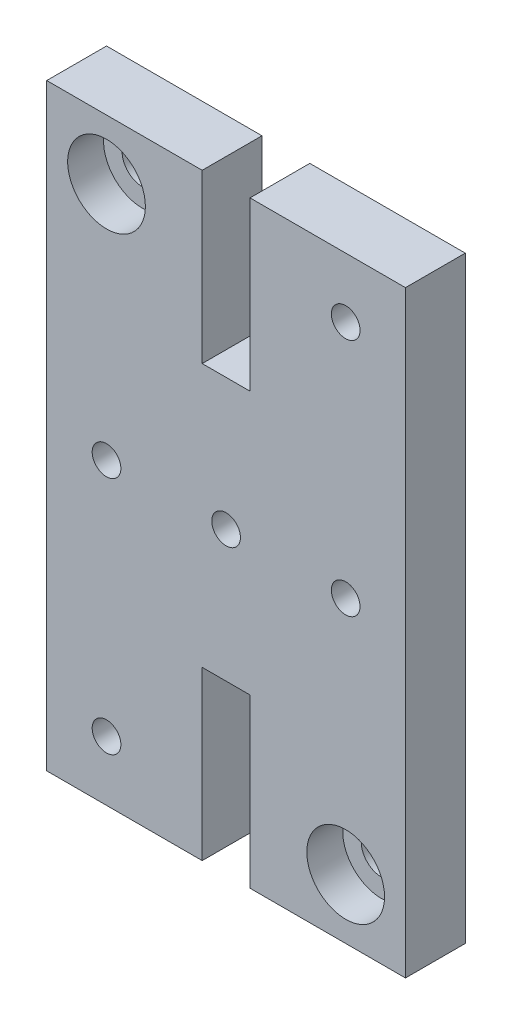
from build123d import *

# Parameters (mm, degrees)
EXTRUSION1_DEPTH                                = 5
CHAMBRAGE_POUR_VIS_T_TE_CYLINDRIQUE_D           = 3.4
CHAMBRAGE_POUR_VIS_T_TE_CYLINDRIQUE_DEPTH       = 10
CHAMBRAGE_POUR_VIS_T_TE_CYLINDRIQUE_CBORE_D     = 6.5
CHAMBRAGE_POUR_VIS_T_TE_CYLINDRIQUE_CBORE_DEPTH = 3
CHAMBRAGE_POUR_VIS_T_TE_CYLINDRIQUE_TIP         = 1.021463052
TROU_TARAUD_M3X0_51_D                           = 2.4


with BuildPart() as part:
    # Esquisse1 → Extrusion1 (new body)
    with BuildSketch(Plane.XY):
        Polygon((15, 25), (15, -25), (2, -25), (2, -11), (-2, -11), (-2, -25), (-15, -25), (-15, 25), (-2, 25), (-2, 11), (2, 11), (2, 25), align=None)
    extrude(amount=EXTRUSION1_DEPTH)

    # Chambrage pour vis _ t_te cylindrique
    with Locations(Plane.XY.offset(5)):
        with Locations((-10, 20), (10, -20)):
            CounterBoreHole(CHAMBRAGE_POUR_VIS_T_TE_CYLINDRIQUE_D / 2, CHAMBRAGE_POUR_VIS_T_TE_CYLINDRIQUE_CBORE_D / 2, CHAMBRAGE_POUR_VIS_T_TE_CYLINDRIQUE_CBORE_DEPTH, depth=CHAMBRAGE_POUR_VIS_T_TE_CYLINDRIQUE_DEPTH)
            with Locations((0, 0, -(CHAMBRAGE_POUR_VIS_T_TE_CYLINDRIQUE_DEPTH + CHAMBRAGE_POUR_VIS_T_TE_CYLINDRIQUE_TIP / 2))):  # 118° drill point
                Cone(0, CHAMBRAGE_POUR_VIS_T_TE_CYLINDRIQUE_D / 2, CHAMBRAGE_POUR_VIS_T_TE_CYLINDRIQUE_TIP, mode=Mode.SUBTRACT)

    # Trou taraud_ M3x0.51 (through all)
    with Locations(Plane.XY.offset(5)):
        with Locations((10, 0), (10, 20), (0, 0), (-10, 0), (-10, -20)):
            Hole(TROU_TARAUD_M3X0_51_D / 2)


solid = part.part
